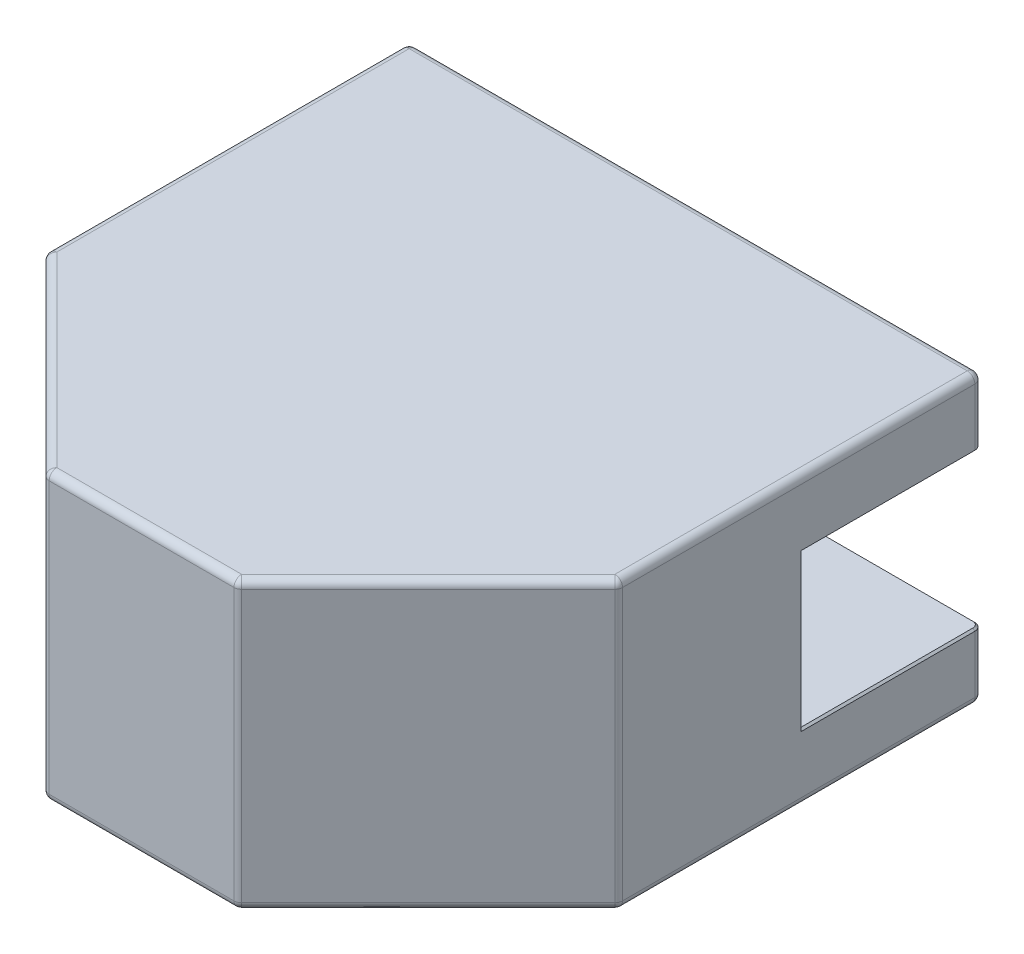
ISO-10303-21;
HEADER;
FILE_DESCRIPTION(('STEP AP214'),'2;1');
FILE_NAME('part.step','',(''),(''),'','','');
FILE_SCHEMA(('AUTOMOTIVE_DESIGN { 1 0 10303 214 1 1 1 1 }'));
ENDSEC;
DATA;
#1=APPLICATION_CONTEXT('core data for automotive mechanical design processes');
#2=APPLICATION_PROTOCOL_DEFINITION('international standard','automotive_design',2000,#1);
#3=PRODUCT_CONTEXT('',#1,'mechanical');
#4=PRODUCT('Part','Part','',(#3));
#5=PRODUCT_RELATED_PRODUCT_CATEGORY('part','',(#4));
#6=PRODUCT_DEFINITION_FORMATION('','',#4);
#7=PRODUCT_DEFINITION_CONTEXT('part definition',#1,'design');
#8=PRODUCT_DEFINITION('design','',#6,#7);
#9=PRODUCT_DEFINITION_SHAPE('','',#8);
#10=(LENGTH_UNIT() NAMED_UNIT(*) SI_UNIT(.MILLI.,.METRE.));
#11=(NAMED_UNIT(*) PLANE_ANGLE_UNIT() SI_UNIT($,.RADIAN.));
#12=(NAMED_UNIT(*) SI_UNIT($,.STERADIAN.) SOLID_ANGLE_UNIT());
#13=UNCERTAINTY_MEASURE_WITH_UNIT(LENGTH_MEASURE(1.E-05),#10,'distance_accuracy_value','');
#14=(GEOMETRIC_REPRESENTATION_CONTEXT(3) GLOBAL_UNCERTAINTY_ASSIGNED_CONTEXT((#13)) GLOBAL_UNIT_ASSIGNED_CONTEXT((#10,
#11,#12)) REPRESENTATION_CONTEXT('',''));
#15=CARTESIAN_POINT('',(0.,0.,0.));
#16=DIRECTION('',(0.,0.,1.));
#17=DIRECTION('',(1.,0.,0.));
#18=AXIS2_PLACEMENT_3D('',#15,#16,#17);
#19=CARTESIAN_POINT('',(0.,75.,0.));
#20=DIRECTION('',(0.,0.,1.));
#21=DIRECTION('',(1.,0.,0.));
#22=AXIS2_PLACEMENT_3D('',#19,#20,#21);
#23=PLANE('',#22);
#24=DIRECTION('',(0.,-1.,0.));
#25=VECTOR('',#24,1.);
#26=CARTESIAN_POINT('',(148.,75.,0.));
#27=LINE('',#26,#25);
#28=CARTESIAN_POINT('',(148.,73.,0.));
#29=VERTEX_POINT('',#28);
#30=CARTESIAN_POINT('',(148.,58.0000000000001,0.));
#31=VERTEX_POINT('',#30);
#32=EDGE_CURVE('E397',#29,#31,#27,.T.);
#33=ORIENTED_EDGE('',*,*,#32,.T.);
#34=DIRECTION('',(-1.,0.,0.));
#35=VECTOR('',#34,1.);
#36=CARTESIAN_POINT('',(0.,58.,0.));
#37=LINE('',#36,#35);
#38=CARTESIAN_POINT('',(2.,58.0000000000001,0.));
#39=VERTEX_POINT('',#38);
#40=EDGE_CURVE('E510',#31,#39,#37,.T.);
#41=ORIENTED_EDGE('',*,*,#40,.T.);
#42=DIRECTION('',(0.,-1.,0.));
#43=VECTOR('',#42,1.);
#44=CARTESIAN_POINT('',(2.,75.,0.));
#45=LINE('',#44,#43);
#46=CARTESIAN_POINT('',(2.,73.,0.));
#47=VERTEX_POINT('',#46);
#48=EDGE_CURVE('E402',#39,#47,#45,.F.);
#49=ORIENTED_EDGE('',*,*,#48,.T.);
#50=DIRECTION('',(-1.,0.,0.));
#51=VECTOR('',#50,1.);
#52=CARTESIAN_POINT('',(0.,73.,0.));
#53=LINE('',#52,#51);
#54=EDGE_CURVE('E400',#47,#29,#53,.F.);
#55=ORIENTED_EDGE('',*,*,#54,.T.);
#56=EDGE_LOOP('',(#33,#41,#49,#55));
#57=FACE_BOUND('',#56,.T.);
#58=ADVANCED_FACE('F49',(#57),#23,.F.);
#59=CARTESIAN_POINT('',(0.,75.,95.));
#60=DIRECTION('',(1.,0.,0.));
#61=DIRECTION('',(0.,0.,-1.));
#62=AXIS2_PLACEMENT_3D('',#59,#60,#61);
#63=PLANE('',#62);
#64=DIRECTION('',(0.,-1.,0.));
#65=VECTOR('',#64,1.);
#66=CARTESIAN_POINT('',(0.,75.,2.));
#67=LINE('',#66,#65);
#68=CARTESIAN_POINT('',(0.,73.,2.));
#69=VERTEX_POINT('',#68);
#70=CARTESIAN_POINT('',(0.,58.0000000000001,2.));
#71=VERTEX_POINT('',#70);
#72=EDGE_CURVE('E357',#69,#71,#67,.T.);
#73=ORIENTED_EDGE('',*,*,#72,.T.);
#74=DIRECTION('',(0.,0.,1.));
#75=VECTOR('',#74,1.);
#76=CARTESIAN_POINT('',(0.,58.,95.));
#77=LINE('',#76,#75);
#78=CARTESIAN_POINT('',(0.,58.,47.5));
#79=VERTEX_POINT('',#78);
#80=EDGE_CURVE('E517',#71,#79,#77,.T.);
#81=ORIENTED_EDGE('',*,*,#80,.T.);
#82=DIRECTION('',(0.,-1.,0.));
#83=VECTOR('',#82,1.);
#84=CARTESIAN_POINT('',(0.,17.5,47.5));
#85=LINE('',#84,#83);
#86=CARTESIAN_POINT('',(0.,17.,47.5));
#87=VERTEX_POINT('',#86);
#88=EDGE_CURVE('E515',#79,#87,#85,.T.);
#89=ORIENTED_EDGE('',*,*,#88,.T.);
#90=DIRECTION('',(0.,0.,-1.));
#91=VECTOR('',#90,1.);
#92=CARTESIAN_POINT('',(0.,17.,95.));
#93=LINE('',#92,#91);
#94=CARTESIAN_POINT('',(0.,17.,2.));
#95=VERTEX_POINT('',#94);
#96=EDGE_CURVE('E513',#87,#95,#93,.T.);
#97=ORIENTED_EDGE('',*,*,#96,.T.);
#98=DIRECTION('',(0.,-1.,0.));
#99=VECTOR('',#98,1.);
#100=CARTESIAN_POINT('',(0.,75.,2.));
#101=LINE('',#100,#99);
#102=CARTESIAN_POINT('',(0.,2.,2.));
#103=VERTEX_POINT('',#102);
#104=EDGE_CURVE('E349',#95,#103,#101,.T.);
#105=ORIENTED_EDGE('',*,*,#104,.T.);
#106=DIRECTION('',(0.,0.,1.));
#107=VECTOR('',#106,1.);
#108=CARTESIAN_POINT('',(0.,2.,95.));
#109=LINE('',#108,#107);
#110=CARTESIAN_POINT('',(0.,2.,94.1715728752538));
#111=VERTEX_POINT('',#110);
#112=EDGE_CURVE('E351',#103,#111,#109,.T.);
#113=ORIENTED_EDGE('',*,*,#112,.T.);
#114=DIRECTION('',(0.,-1.,0.));
#115=VECTOR('',#114,1.);
#116=CARTESIAN_POINT('',(0.,75.,94.1715728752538));
#117=LINE('',#116,#115);
#118=CARTESIAN_POINT('',(0.,73.,94.1715728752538));
#119=VERTEX_POINT('',#118);
#120=EDGE_CURVE('E353',#111,#119,#117,.F.);
#121=ORIENTED_EDGE('',*,*,#120,.T.);
#122=DIRECTION('',(0.,0.,1.));
#123=VECTOR('',#122,1.);
#124=CARTESIAN_POINT('',(0.,73.,95.));
#125=LINE('',#124,#123);
#126=EDGE_CURVE('E355',#119,#69,#125,.F.);
#127=ORIENTED_EDGE('',*,*,#126,.T.);
#128=EDGE_LOOP('',(#73,#81,#89,#97,#105,#113,#121,#127));
#129=FACE_BOUND('',#128,.T.);
#130=ADVANCED_FACE('F633',(#129),#63,.F.);
#131=CARTESIAN_POINT('',(49.9999999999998,75.,145.));
#132=DIRECTION('',(0.707106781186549,0.,-0.707106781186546));
#133=DIRECTION('',(-0.707106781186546,0.,-0.707106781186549));
#134=AXIS2_PLACEMENT_3D('',#131,#132,#133);
#135=PLANE('',#134);
#136=DIRECTION('',(0.,-1.,0.));
#137=VECTOR('',#136,1.);
#138=CARTESIAN_POINT('',(0.585786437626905,75.,95.5857864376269));
#139=LINE('',#138,#137);
#140=CARTESIAN_POINT('',(0.585786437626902,73.,95.5857864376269));
#141=VERTEX_POINT('',#140);
#142=CARTESIAN_POINT('',(0.585786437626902,2.,95.5857864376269));
#143=VERTEX_POINT('',#142);
#144=EDGE_CURVE('E343',#141,#143,#139,.T.);
#145=ORIENTED_EDGE('',*,*,#144,.T.);
#146=DIRECTION('',(0.707106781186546,0.,0.707106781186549));
#147=VECTOR('',#146,1.);
#148=CARTESIAN_POINT('',(49.9999999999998,2.,145.));
#149=LINE('',#148,#147);
#150=CARTESIAN_POINT('',(49.4142135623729,2.,144.414213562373));
#151=VERTEX_POINT('',#150);
#152=EDGE_CURVE('E346',#143,#151,#149,.T.);
#153=ORIENTED_EDGE('',*,*,#152,.T.);
#154=DIRECTION('',(0.,-1.,0.));
#155=VECTOR('',#154,1.);
#156=CARTESIAN_POINT('',(49.4142135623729,75.,144.414213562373));
#157=LINE('',#156,#155);
#158=CARTESIAN_POINT('',(49.4142135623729,73.,144.414213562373));
#159=VERTEX_POINT('',#158);
#160=EDGE_CURVE('E340',#151,#159,#157,.F.);
#161=ORIENTED_EDGE('',*,*,#160,.T.);
#162=DIRECTION('',(0.707106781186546,0.,0.707106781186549));
#163=VECTOR('',#162,1.);
#164=CARTESIAN_POINT('',(49.9999999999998,73.,145.));
#165=LINE('',#164,#163);
#166=EDGE_CURVE('E338',#159,#141,#165,.F.);
#167=ORIENTED_EDGE('',*,*,#166,.T.);
#168=EDGE_LOOP('',(#145,#153,#161,#167));
#169=FACE_BOUND('',#168,.T.);
#170=ADVANCED_FACE('F758',(#169),#135,.F.);
#171=CARTESIAN_POINT('',(100.,75.,145.));
#172=DIRECTION('',(0.,0.,-1.));
#173=DIRECTION('',(-1.,0.,0.));
#174=AXIS2_PLACEMENT_3D('',#171,#172,#173);
#175=PLANE('',#174);
#176=DIRECTION('',(0.,-1.,0.));
#177=VECTOR('',#176,1.);
#178=CARTESIAN_POINT('',(50.828427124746,75.,145.));
#179=LINE('',#178,#177);
#180=CARTESIAN_POINT('',(50.828427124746,73.,145.));
#181=VERTEX_POINT('',#180);
#182=CARTESIAN_POINT('',(50.828427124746,2.,145.));
#183=VERTEX_POINT('',#182);
#184=EDGE_CURVE('E315',#181,#183,#179,.T.);
#185=ORIENTED_EDGE('',*,*,#184,.T.);
#186=DIRECTION('',(1.,0.,0.));
#187=VECTOR('',#186,1.);
#188=CARTESIAN_POINT('',(100.,2.,145.));
#189=LINE('',#188,#187);
#190=CARTESIAN_POINT('',(99.171572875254,2.,145.));
#191=VERTEX_POINT('',#190);
#192=EDGE_CURVE('E322',#183,#191,#189,.T.);
#193=ORIENTED_EDGE('',*,*,#192,.T.);
#194=DIRECTION('',(0.,-1.,0.));
#195=VECTOR('',#194,1.);
#196=CARTESIAN_POINT('',(99.171572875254,75.,145.));
#197=LINE('',#196,#195);
#198=CARTESIAN_POINT('',(99.171572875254,73.,145.));
#199=VERTEX_POINT('',#198);
#200=EDGE_CURVE('E318',#191,#199,#197,.F.);
#201=ORIENTED_EDGE('',*,*,#200,.T.);
#202=DIRECTION('',(1.,0.,0.));
#203=VECTOR('',#202,1.);
#204=CARTESIAN_POINT('',(100.,73.,145.));
#205=LINE('',#204,#203);
#206=EDGE_CURVE('E313',#199,#181,#205,.F.);
#207=ORIENTED_EDGE('',*,*,#206,.T.);
#208=EDGE_LOOP('',(#185,#193,#201,#207));
#209=FACE_BOUND('',#208,.T.);
#210=ADVANCED_FACE('F749',(#209),#175,.F.);
#211=CARTESIAN_POINT('',(150.,75.,95.));
#212=DIRECTION('',(-0.707106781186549,0.,-0.707106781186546));
#213=DIRECTION('',(-0.707106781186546,0.,0.707106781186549));
#214=AXIS2_PLACEMENT_3D('',#211,#212,#213);
#215=PLANE('',#214);
#216=DIRECTION('',(0.,-1.,0.));
#217=VECTOR('',#216,1.);
#218=CARTESIAN_POINT('',(100.585786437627,75.,144.414213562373));
#219=LINE('',#218,#217);
#220=CARTESIAN_POINT('',(100.585786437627,73.,144.414213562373));
#221=VERTEX_POINT('',#220);
#222=CARTESIAN_POINT('',(100.585786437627,2.,144.414213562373));
#223=VERTEX_POINT('',#222);
#224=EDGE_CURVE('E270',#221,#223,#219,.T.);
#225=ORIENTED_EDGE('',*,*,#224,.T.);
#226=DIRECTION('',(0.707106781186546,0.,-0.707106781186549));
#227=VECTOR('',#226,1.);
#228=CARTESIAN_POINT('',(150.,2.,95.));
#229=LINE('',#228,#227);
#230=CARTESIAN_POINT('',(149.414213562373,2.,95.5857864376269));
#231=VERTEX_POINT('',#230);
#232=EDGE_CURVE('E265',#223,#231,#229,.T.);
#233=ORIENTED_EDGE('',*,*,#232,.T.);
#234=DIRECTION('',(0.,-1.,0.));
#235=VECTOR('',#234,1.);
#236=CARTESIAN_POINT('',(149.414213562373,75.,95.5857864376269));
#237=LINE('',#236,#235);
#238=CARTESIAN_POINT('',(149.414213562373,73.,95.5857864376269));
#239=VERTEX_POINT('',#238);
#240=EDGE_CURVE('E257',#231,#239,#237,.F.);
#241=ORIENTED_EDGE('',*,*,#240,.T.);
#242=DIRECTION('',(0.707106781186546,0.,-0.707106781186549));
#243=VECTOR('',#242,1.);
#244=CARTESIAN_POINT('',(150.,73.,95.));
#245=LINE('',#244,#243);
#246=EDGE_CURVE('E262',#239,#221,#245,.F.);
#247=ORIENTED_EDGE('',*,*,#246,.T.);
#248=EDGE_LOOP('',(#225,#233,#241,#247));
#249=FACE_BOUND('',#248,.T.);
#250=ADVANCED_FACE('F260',(#249),#215,.F.);
#251=CARTESIAN_POINT('',(150.,75.,0.));
#252=DIRECTION('',(-1.,0.,0.));
#253=DIRECTION('',(0.,0.,1.));
#254=AXIS2_PLACEMENT_3D('',#251,#252,#253);
#255=PLANE('',#254);
#256=DIRECTION('',(0.,1.,0.));
#257=VECTOR('',#256,1.);
#258=CARTESIAN_POINT('',(150.,57.5,47.5000000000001));
#259=LINE('',#258,#257);
#260=CARTESIAN_POINT('',(150.,16.9999999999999,47.5000000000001));
#261=VERTEX_POINT('',#260);
#262=CARTESIAN_POINT('',(150.,58.0000000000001,47.5000000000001));
#263=VERTEX_POINT('',#262);
#264=EDGE_CURVE('E542',#261,#263,#259,.T.);
#265=ORIENTED_EDGE('',*,*,#264,.T.);
#266=DIRECTION('',(0.,0.,-1.));
#267=VECTOR('',#266,1.);
#268=CARTESIAN_POINT('',(150.,58.0000000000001,0.));
#269=LINE('',#268,#267);
#270=CARTESIAN_POINT('',(150.,58.0000000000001,2.));
#271=VERTEX_POINT('',#270);
#272=EDGE_CURVE('E545',#263,#271,#269,.T.);
#273=ORIENTED_EDGE('',*,*,#272,.T.);
#274=DIRECTION('',(0.,-1.,0.));
#275=VECTOR('',#274,1.);
#276=CARTESIAN_POINT('',(150.,75.,2.));
#277=LINE('',#276,#275);
#278=CARTESIAN_POINT('',(150.,73.,2.));
#279=VERTEX_POINT('',#278);
#280=EDGE_CURVE('E325',#271,#279,#277,.F.);
#281=ORIENTED_EDGE('',*,*,#280,.T.);
#282=DIRECTION('',(0.,0.,-1.));
#283=VECTOR('',#282,1.);
#284=CARTESIAN_POINT('',(150.,73.,0.));
#285=LINE('',#284,#283);
#286=CARTESIAN_POINT('',(150.,73.,94.1715728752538));
#287=VERTEX_POINT('',#286);
#288=EDGE_CURVE('E327',#279,#287,#285,.F.);
#289=ORIENTED_EDGE('',*,*,#288,.T.);
#290=DIRECTION('',(0.,-1.,0.));
#291=VECTOR('',#290,1.);
#292=CARTESIAN_POINT('',(150.,75.,94.1715728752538));
#293=LINE('',#292,#291);
#294=CARTESIAN_POINT('',(150.,2.,94.1715728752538));
#295=VERTEX_POINT('',#294);
#296=EDGE_CURVE('E278',#287,#295,#293,.T.);
#297=ORIENTED_EDGE('',*,*,#296,.T.);
#298=DIRECTION('',(0.,0.,-1.));
#299=VECTOR('',#298,1.);
#300=CARTESIAN_POINT('',(150.,2.,0.));
#301=LINE('',#300,#299);
#302=CARTESIAN_POINT('',(150.,2.,2.));
#303=VERTEX_POINT('',#302);
#304=EDGE_CURVE('E332',#295,#303,#301,.T.);
#305=ORIENTED_EDGE('',*,*,#304,.T.);
#306=DIRECTION('',(0.,-1.,0.));
#307=VECTOR('',#306,1.);
#308=CARTESIAN_POINT('',(150.,75.,2.));
#309=LINE('',#308,#307);
#310=CARTESIAN_POINT('',(150.,17.,2.));
#311=VERTEX_POINT('',#310);
#312=EDGE_CURVE('E335',#303,#311,#309,.F.);
#313=ORIENTED_EDGE('',*,*,#312,.T.);
#314=DIRECTION('',(0.,0.,1.));
#315=VECTOR('',#314,1.);
#316=CARTESIAN_POINT('',(150.,16.9999999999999,0.));
#317=LINE('',#316,#315);
#318=EDGE_CURVE('E539',#311,#261,#317,.T.);
#319=ORIENTED_EDGE('',*,*,#318,.T.);
#320=EDGE_LOOP('',(#265,#273,#281,#289,#297,#305,#313,#319));
#321=FACE_BOUND('',#320,.T.);
#322=ADVANCED_FACE('F603',(#321),#255,.F.);
#323=DIRECTION('',(0.,-1.,0.));
#324=VECTOR('',#323,1.);
#325=CARTESIAN_POINT('',(2.,75.,0.));
#326=LINE('',#325,#324);
#327=CARTESIAN_POINT('',(2.,2.,0.));
#328=VERTEX_POINT('',#327);
#329=CARTESIAN_POINT('',(2.,17.,0.));
#330=VERTEX_POINT('',#329);
#331=EDGE_CURVE('E381',#328,#330,#326,.F.);
#332=ORIENTED_EDGE('',*,*,#331,.T.);
#333=DIRECTION('',(1.,0.,0.));
#334=VECTOR('',#333,1.);
#335=CARTESIAN_POINT('',(0.,17.,0.));
#336=LINE('',#335,#334);
#337=CARTESIAN_POINT('',(148.,17.,0.));
#338=VERTEX_POINT('',#337);
#339=EDGE_CURVE('E11',#330,#338,#336,.T.);
#340=ORIENTED_EDGE('',*,*,#339,.T.);
#341=DIRECTION('',(0.,-1.,0.));
#342=VECTOR('',#341,1.);
#343=CARTESIAN_POINT('',(148.,75.,0.));
#344=LINE('',#343,#342);
#345=CARTESIAN_POINT('',(148.,2.,0.));
#346=VERTEX_POINT('',#345);
#347=EDGE_CURVE('E377',#338,#346,#344,.T.);
#348=ORIENTED_EDGE('',*,*,#347,.T.);
#349=DIRECTION('',(-1.,0.,0.));
#350=VECTOR('',#349,1.);
#351=CARTESIAN_POINT('',(0.,2.,0.));
#352=LINE('',#351,#350);
#353=EDGE_CURVE('E379',#346,#328,#352,.T.);
#354=ORIENTED_EDGE('',*,*,#353,.T.);
#355=EDGE_LOOP('',(#332,#340,#348,#354));
#356=FACE_BOUND('',#355,.T.);
#357=ADVANCED_FACE('F620',(#356),#23,.F.);
#358=CARTESIAN_POINT('',(0.,75.,0.));
#359=DIRECTION('',(0.,-1.,0.));
#360=DIRECTION('',(0.,0.,-1.));
#361=AXIS2_PLACEMENT_3D('',#358,#359,#360);
#362=PLANE('',#361);
#363=DIRECTION('',(0.,0.,-1.));
#364=VECTOR('',#363,1.);
#365=CARTESIAN_POINT('',(148.,75.,0.));
#366=LINE('',#365,#364);
#367=CARTESIAN_POINT('',(148.,75.,94.1715728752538));
#368=VERTEX_POINT('',#367);
#369=CARTESIAN_POINT('',(148.,75.,2.));
#370=VERTEX_POINT('',#369);
#371=EDGE_CURVE('E391',#368,#370,#366,.T.);
#372=ORIENTED_EDGE('',*,*,#371,.T.);
#373=DIRECTION('',(-1.,0.,0.));
#374=VECTOR('',#373,1.);
#375=CARTESIAN_POINT('',(0.,75.,2.));
#376=LINE('',#375,#374);
#377=CARTESIAN_POINT('',(2.,75.,2.));
#378=VERTEX_POINT('',#377);
#379=EDGE_CURVE('E394',#370,#378,#376,.T.);
#380=ORIENTED_EDGE('',*,*,#379,.T.);
#381=DIRECTION('',(0.,0.,1.));
#382=VECTOR('',#381,1.);
#383=CARTESIAN_POINT('',(2.,75.,0.));
#384=LINE('',#383,#382);
#385=CARTESIAN_POINT('',(2.,75.,94.1715728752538));
#386=VERTEX_POINT('',#385);
#387=EDGE_CURVE('E383',#378,#386,#384,.T.);
#388=ORIENTED_EDGE('',*,*,#387,.T.);
#389=DIRECTION('',(0.707106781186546,0.,0.707106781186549));
#390=VECTOR('',#389,1.);
#391=CARTESIAN_POINT('',(-46.0857864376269,75.,46.0857864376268));
#392=LINE('',#391,#390);
#393=CARTESIAN_POINT('',(50.828427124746,75.,143.));
#394=VERTEX_POINT('',#393);
#395=EDGE_CURVE('E385',#386,#394,#392,.T.);
#396=ORIENTED_EDGE('',*,*,#395,.T.);
#397=DIRECTION('',(1.,0.,0.));
#398=VECTOR('',#397,1.);
#399=CARTESIAN_POINT('',(0.,75.,143.));
#400=LINE('',#399,#398);
#401=CARTESIAN_POINT('',(99.171572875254,75.,143.));
#402=VERTEX_POINT('',#401);
#403=EDGE_CURVE('E387',#394,#402,#400,.T.);
#404=ORIENTED_EDGE('',*,*,#403,.T.);
#405=DIRECTION('',(0.707106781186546,0.,-0.707106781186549));
#406=VECTOR('',#405,1.);
#407=CARTESIAN_POINT('',(121.085786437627,75.,121.085786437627));
#408=LINE('',#407,#406);
#409=EDGE_CURVE('E389',#402,#368,#408,.T.);
#410=ORIENTED_EDGE('',*,*,#409,.T.);
#411=EDGE_LOOP('',(#372,#380,#388,#396,#404,#410));
#412=FACE_BOUND('',#411,.T.);
#413=ADVANCED_FACE('F729',(#412),#362,.F.);
#414=CARTESIAN_POINT('',(0.,0.,0.));
#415=DIRECTION('',(0.,-1.,0.));
#416=DIRECTION('',(0.,0.,-1.));
#417=AXIS2_PLACEMENT_3D('',#414,#415,#416);
#418=PLANE('',#417);
#419=CARTESIAN_POINT('',(75.,0.,115.));
#420=DIRECTION('',(0.,-1.,0.));
#421=DIRECTION('',(0.,0.,-1.));
#422=AXIS2_PLACEMENT_3D('',#419,#420,#421);
#423=CIRCLE('',#422,16.);
#424=CARTESIAN_POINT('',(75.,0.,99.));
#425=VERTEX_POINT('',#424);
#426=EDGE_CURVE('E709',#425,#425,#423,.T.);
#427=ORIENTED_EDGE('',*,*,#426,.F.);
#428=EDGE_LOOP('',(#427));
#429=FACE_BOUND('',#428,.T.);
#430=DIRECTION('',(1.,0.,0.));
#431=VECTOR('',#430,1.);
#432=CARTESIAN_POINT('',(49.9999999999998,0.,143.));
#433=LINE('',#432,#431);
#434=CARTESIAN_POINT('',(99.171572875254,0.,143.));
#435=VERTEX_POINT('',#434);
#436=CARTESIAN_POINT('',(50.828427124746,0.,143.));
#437=VERTEX_POINT('',#436);
#438=EDGE_CURVE('E370',#435,#437,#433,.F.);
#439=ORIENTED_EDGE('',*,*,#438,.T.);
#440=DIRECTION('',(0.707106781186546,0.,0.707106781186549));
#441=VECTOR('',#440,1.);
#442=CARTESIAN_POINT('',(1.4142135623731,0.,93.5857864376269));
#443=LINE('',#442,#441);
#444=CARTESIAN_POINT('',(2.,0.,94.1715728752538));
#445=VERTEX_POINT('',#444);
#446=EDGE_CURVE('E373',#437,#445,#443,.F.);
#447=ORIENTED_EDGE('',*,*,#446,.T.);
#448=DIRECTION('',(0.,0.,1.));
#449=VECTOR('',#448,1.);
#450=CARTESIAN_POINT('',(2.,0.,0.));
#451=LINE('',#450,#449);
#452=CARTESIAN_POINT('',(2.,0.,2.));
#453=VERTEX_POINT('',#452);
#454=EDGE_CURVE('E360',#445,#453,#451,.F.);
#455=ORIENTED_EDGE('',*,*,#454,.T.);
#456=DIRECTION('',(-1.,0.,0.));
#457=VECTOR('',#456,1.);
#458=CARTESIAN_POINT('',(150.,0.,2.));
#459=LINE('',#458,#457);
#460=CARTESIAN_POINT('',(148.,0.,2.));
#461=VERTEX_POINT('',#460);
#462=EDGE_CURVE('E362',#453,#461,#459,.F.);
#463=ORIENTED_EDGE('',*,*,#462,.T.);
#464=DIRECTION('',(0.,0.,-1.));
#465=VECTOR('',#464,1.);
#466=CARTESIAN_POINT('',(148.,0.,95.));
#467=LINE('',#466,#465);
#468=CARTESIAN_POINT('',(148.,0.,94.1715728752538));
#469=VERTEX_POINT('',#468);
#470=EDGE_CURVE('E364',#461,#469,#467,.F.);
#471=ORIENTED_EDGE('',*,*,#470,.T.);
#472=DIRECTION('',(0.707106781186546,0.,-0.707106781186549));
#473=VECTOR('',#472,1.);
#474=CARTESIAN_POINT('',(98.5857864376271,0.,143.585786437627));
#475=LINE('',#474,#473);
#476=EDGE_CURVE('E367',#469,#435,#475,.F.);
#477=ORIENTED_EDGE('',*,*,#476,.T.);
#478=EDGE_LOOP('',(#439,#447,#455,#463,#471,#477));
#479=FACE_BOUND('',#478,.T.);
#480=ADVANCED_FACE('F725',(#429,#479),#418,.T.);
#481=CARTESIAN_POINT('',(150.,57.5,47.));
#482=DIRECTION('',(0.,1.,0.));
#483=DIRECTION('',(0.,0.,1.));
#484=AXIS2_PLACEMENT_3D('',#481,#482,#483);
#485=PLANE('',#484);
#486=DIRECTION('',(1.,0.,0.));
#487=VECTOR('',#486,1.);
#488=CARTESIAN_POINT('',(150.,57.5,47.));
#489=LINE('',#488,#487);
#490=CARTESIAN_POINT('',(0.500000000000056,57.5,47.));
#491=VERTEX_POINT('',#490);
#492=CARTESIAN_POINT('',(149.5,57.5,47.));
#493=VERTEX_POINT('',#492);
#494=EDGE_CURVE('E300',#491,#493,#489,.T.);
#495=ORIENTED_EDGE('',*,*,#494,.F.);
#496=DIRECTION('',(0.,0.,-1.));
#497=VECTOR('',#496,1.);
#498=CARTESIAN_POINT('',(0.500000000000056,57.5,47.));
#499=LINE('',#498,#497);
#500=CARTESIAN_POINT('',(0.500000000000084,57.5,2.));
#501=VERTEX_POINT('',#500);
#502=EDGE_CURVE('E508',#491,#501,#499,.T.);
#503=ORIENTED_EDGE('',*,*,#502,.T.);
#504=CARTESIAN_POINT('',(2.,57.5,2.));
#505=DIRECTION('',(0.,1.,0.));
#506=DIRECTION('',(0.,0.,1.));
#507=AXIS2_PLACEMENT_3D('',#504,#505,#506);
#508=CIRCLE('',#507,1.49999999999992);
#509=CARTESIAN_POINT('',(2.,57.5,0.5));
#510=VERTEX_POINT('',#509);
#511=EDGE_CURVE('E506',#501,#510,#508,.F.);
#512=ORIENTED_EDGE('',*,*,#511,.T.);
#513=DIRECTION('',(1.,0.,0.));
#514=VECTOR('',#513,1.);
#515=CARTESIAN_POINT('',(150.,57.5,0.5));
#516=LINE('',#515,#514);
#517=CARTESIAN_POINT('',(148.,57.5,0.500000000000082));
#518=VERTEX_POINT('',#517);
#519=EDGE_CURVE('E503',#510,#518,#516,.T.);
#520=ORIENTED_EDGE('',*,*,#519,.T.);
#521=CARTESIAN_POINT('',(148.,57.5,2.));
#522=DIRECTION('',(0.,1.,0.));
#523=DIRECTION('',(0.,0.,1.));
#524=AXIS2_PLACEMENT_3D('',#521,#522,#523);
#525=CIRCLE('',#524,1.49999999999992);
#526=CARTESIAN_POINT('',(149.5,57.5,2.));
#527=VERTEX_POINT('',#526);
#528=EDGE_CURVE('E501',#518,#527,#525,.F.);
#529=ORIENTED_EDGE('',*,*,#528,.T.);
#530=DIRECTION('',(0.,0.,1.));
#531=VECTOR('',#530,1.);
#532=CARTESIAN_POINT('',(149.5,57.5,47.));
#533=LINE('',#532,#531);
#534=EDGE_CURVE('E404',#527,#493,#533,.T.);
#535=ORIENTED_EDGE('',*,*,#534,.T.);
#536=EDGE_LOOP('',(#495,#503,#512,#520,#529,#535));
#537=FACE_BOUND('',#536,.T.);
#538=ADVANCED_FACE('F728',(#537),#485,.F.);
#539=CARTESIAN_POINT('',(150.,17.5,47.));
#540=DIRECTION('',(0.,-1.,0.));
#541=DIRECTION('',(0.,0.,-1.));
#542=AXIS2_PLACEMENT_3D('',#539,#540,#541);
#543=PLANE('',#542);
#544=CARTESIAN_POINT('',(2.,17.5,2.));
#545=DIRECTION('',(0.,-1.,0.));
#546=DIRECTION('',(0.,0.,-1.));
#547=AXIS2_PLACEMENT_3D('',#544,#545,#546);
#548=CIRCLE('',#547,1.5);
#549=CARTESIAN_POINT('',(2.,17.5,0.5));
#550=VERTEX_POINT('',#549);
#551=CARTESIAN_POINT('',(0.5,17.5,2.));
#552=VERTEX_POINT('',#551);
#553=EDGE_CURVE('E526',#550,#552,#548,.F.);
#554=ORIENTED_EDGE('',*,*,#553,.T.);
#555=DIRECTION('',(0.,0.,1.));
#556=VECTOR('',#555,1.);
#557=CARTESIAN_POINT('',(0.500000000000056,17.5,47.));
#558=LINE('',#557,#556);
#559=CARTESIAN_POINT('',(0.500000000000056,17.5,47.));
#560=VERTEX_POINT('',#559);
#561=EDGE_CURVE('E533',#552,#560,#558,.T.);
#562=ORIENTED_EDGE('',*,*,#561,.T.);
#563=DIRECTION('',(-1.,0.,0.));
#564=VECTOR('',#563,1.);
#565=CARTESIAN_POINT('',(150.,17.5,47.));
#566=LINE('',#565,#564);
#567=CARTESIAN_POINT('',(149.5,17.5,47.));
#568=VERTEX_POINT('',#567);
#569=EDGE_CURVE('E306',#568,#560,#566,.T.);
#570=ORIENTED_EDGE('',*,*,#569,.F.);
#571=DIRECTION('',(0.,0.,-1.));
#572=VECTOR('',#571,1.);
#573=CARTESIAN_POINT('',(149.5,17.5,47.));
#574=LINE('',#573,#572);
#575=CARTESIAN_POINT('',(149.5,17.5,2.));
#576=VERTEX_POINT('',#575);
#577=EDGE_CURVE('E530',#568,#576,#574,.T.);
#578=ORIENTED_EDGE('',*,*,#577,.T.);
#579=CARTESIAN_POINT('',(148.,17.5,2.));
#580=DIRECTION('',(0.,-1.,0.));
#581=DIRECTION('',(0.,0.,-1.));
#582=AXIS2_PLACEMENT_3D('',#579,#580,#581);
#583=CIRCLE('',#582,1.5);
#584=CARTESIAN_POINT('',(148.,17.5,0.5));
#585=VERTEX_POINT('',#584);
#586=EDGE_CURVE('E528',#576,#585,#583,.F.);
#587=ORIENTED_EDGE('',*,*,#586,.T.);
#588=DIRECTION('',(-1.,0.,0.));
#589=VECTOR('',#588,1.);
#590=CARTESIAN_POINT('',(150.,17.5,0.5));
#591=LINE('',#590,#589);
#592=EDGE_CURVE('E524',#585,#550,#591,.T.);
#593=ORIENTED_EDGE('',*,*,#592,.T.);
#594=EDGE_LOOP('',(#554,#562,#570,#578,#587,#593));
#595=FACE_BOUND('',#594,.T.);
#596=ADVANCED_FACE('F701',(#595),#543,.F.);
#597=CARTESIAN_POINT('',(0.,0.,47.));
#598=DIRECTION('',(0.,0.,-1.));
#599=DIRECTION('',(-1.,0.,0.));
#600=AXIS2_PLACEMENT_3D('',#597,#598,#599);
#601=PLANE('',#600);
#602=ORIENTED_EDGE('',*,*,#569,.T.);
#603=DIRECTION('',(0.,1.,0.));
#604=VECTOR('',#603,1.);
#605=CARTESIAN_POINT('',(0.500000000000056,57.5,47.));
#606=LINE('',#605,#604);
#607=EDGE_CURVE('E522',#560,#491,#606,.T.);
#608=ORIENTED_EDGE('',*,*,#607,.T.);
#609=ORIENTED_EDGE('',*,*,#494,.T.);
#610=DIRECTION('',(0.,-1.,0.));
#611=VECTOR('',#610,1.);
#612=CARTESIAN_POINT('',(149.5,17.5,47.));
#613=LINE('',#612,#611);
#614=EDGE_CURVE('E519',#493,#568,#613,.T.);
#615=ORIENTED_EDGE('',*,*,#614,.T.);
#616=EDGE_LOOP('',(#602,#608,#609,#615));
#617=FACE_BOUND('',#616,.T.);
#618=ADVANCED_FACE('F704',(#617),#601,.T.);
#619=CARTESIAN_POINT('',(2.,75.,2.));
#620=DIRECTION('',(0.,-1.,0.));
#621=DIRECTION('',(0.,0.,-1.));
#622=AXIS2_PLACEMENT_3D('',#619,#620,#621);
#623=CYLINDRICAL_SURFACE('',#622,2.);
#624=ORIENTED_EDGE('',*,*,#48,.F.);
#625=CARTESIAN_POINT('',(2.,58.0000000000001,2.));
#626=DIRECTION('',(0.,1.,0.));
#627=DIRECTION('',(0.,0.,1.));
#628=AXIS2_PLACEMENT_3D('',#625,#626,#627);
#629=CIRCLE('',#628,2.);
#630=EDGE_CURVE('E535',#39,#71,#629,.T.);
#631=ORIENTED_EDGE('',*,*,#630,.T.);
#632=ORIENTED_EDGE('',*,*,#72,.F.);
#633=CARTESIAN_POINT('',(2.,73.,2.));
#634=DIRECTION('',(0.,1.,0.));
#635=DIRECTION('',(0.,0.,1.));
#636=AXIS2_PLACEMENT_3D('',#633,#634,#635);
#637=CIRCLE('',#636,2.);
#638=EDGE_CURVE('E496',#47,#69,#637,.T.);
#639=ORIENTED_EDGE('',*,*,#638,.F.);
#640=EDGE_LOOP('',(#624,#631,#632,#639));
#641=FACE_BOUND('',#640,.T.);
#642=ADVANCED_FACE('F653',(#641),#623,.T.);
#643=CARTESIAN_POINT('',(2.,75.,2.));
#644=DIRECTION('',(0.,-1.,0.));
#645=DIRECTION('',(0.,0.,-1.));
#646=AXIS2_PLACEMENT_3D('',#643,#644,#645);
#647=CYLINDRICAL_SURFACE('',#646,2.);
#648=ORIENTED_EDGE('',*,*,#104,.F.);
#649=CARTESIAN_POINT('',(2.,17.,2.));
#650=DIRECTION('',(0.,-1.,0.));
#651=DIRECTION('',(0.,0.,-1.));
#652=AXIS2_PLACEMENT_3D('',#649,#650,#651);
#653=CIRCLE('',#652,2.);
#654=EDGE_CURVE('E59',#95,#330,#653,.T.);
#655=ORIENTED_EDGE('',*,*,#654,.T.);
#656=ORIENTED_EDGE('',*,*,#331,.F.);
#657=CARTESIAN_POINT('',(2.,2.,2.));
#658=DIRECTION('',(0.,-1.,0.));
#659=DIRECTION('',(0.,0.,-1.));
#660=AXIS2_PLACEMENT_3D('',#657,#658,#659);
#661=CIRCLE('',#660,2.);
#662=EDGE_CURVE('E493',#103,#328,#661,.T.);
#663=ORIENTED_EDGE('',*,*,#662,.F.);
#664=EDGE_LOOP('',(#648,#655,#656,#663));
#665=FACE_BOUND('',#664,.T.);
#666=ADVANCED_FACE('F622',(#665),#647,.T.);
#667=CARTESIAN_POINT('',(2.,73.,2.));
#668=DIRECTION('',(-1.,0.,0.));
#669=DIRECTION('',(0.,0.,1.));
#670=AXIS2_PLACEMENT_3D('',#667,#668,#669);
#671=SPHERICAL_SURFACE('',#670,2.);
#672=CARTESIAN_POINT('',(2.,73.,2.));
#673=DIRECTION('',(-1.,0.,0.));
#674=DIRECTION('',(0.,0.,1.));
#675=AXIS2_PLACEMENT_3D('',#672,#673,#674);
#676=CIRCLE('',#675,2.);
#677=EDGE_CURVE('E487',#47,#378,#676,.F.);
#678=ORIENTED_EDGE('',*,*,#677,.F.);
#679=ORIENTED_EDGE('',*,*,#638,.T.);
#680=CARTESIAN_POINT('',(2.,73.,2.));
#681=DIRECTION('',(0.,0.,-1.));
#682=DIRECTION('',(0.,1.,0.));
#683=AXIS2_PLACEMENT_3D('',#680,#681,#682);
#684=CIRCLE('',#683,2.);
#685=EDGE_CURVE('E490',#378,#69,#684,.F.);
#686=ORIENTED_EDGE('',*,*,#685,.F.);
#687=EDGE_LOOP('',(#678,#679,#686));
#688=FACE_BOUND('',#687,.T.);
#689=ADVANCED_FACE('F657',(#688),#671,.T.);
#690=CARTESIAN_POINT('',(2.,2.,2.));
#691=DIRECTION('',(0.,0.,-1.));
#692=DIRECTION('',(0.,1.,0.));
#693=AXIS2_PLACEMENT_3D('',#690,#691,#692);
#694=SPHERICAL_SURFACE('',#693,2.);
#695=CARTESIAN_POINT('',(2.,2.,2.));
#696=DIRECTION('',(0.,0.,-1.));
#697=DIRECTION('',(-1.,0.,0.));
#698=AXIS2_PLACEMENT_3D('',#695,#696,#697);
#699=CIRCLE('',#698,2.);
#700=EDGE_CURVE('E481',#103,#453,#699,.F.);
#701=ORIENTED_EDGE('',*,*,#700,.F.);
#702=ORIENTED_EDGE('',*,*,#662,.T.);
#703=CARTESIAN_POINT('',(2.,2.,2.));
#704=DIRECTION('',(-1.,0.,0.));
#705=DIRECTION('',(0.,0.,1.));
#706=AXIS2_PLACEMENT_3D('',#703,#704,#705);
#707=CIRCLE('',#706,2.);
#708=EDGE_CURVE('E484',#453,#328,#707,.F.);
#709=ORIENTED_EDGE('',*,*,#708,.F.);
#710=EDGE_LOOP('',(#701,#702,#709));
#711=FACE_BOUND('',#710,.T.);
#712=ADVANCED_FACE('F625',(#711),#694,.T.);
#713=CARTESIAN_POINT('',(2.,73.,0.));
#714=DIRECTION('',(0.,0.,1.));
#715=DIRECTION('',(1.,0.,0.));
#716=AXIS2_PLACEMENT_3D('',#713,#714,#715);
#717=CYLINDRICAL_SURFACE('',#716,2.);
#718=ORIENTED_EDGE('',*,*,#685,.T.);
#719=ORIENTED_EDGE('',*,*,#126,.F.);
#720=CARTESIAN_POINT('',(2.,73.,94.1715728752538));
#721=DIRECTION('',(0.,0.,1.));
#722=DIRECTION('',(1.,0.,0.));
#723=AXIS2_PLACEMENT_3D('',#720,#721,#722);
#724=CIRCLE('',#723,2.);
#725=EDGE_CURVE('E475',#386,#119,#724,.T.);
#726=ORIENTED_EDGE('',*,*,#725,.F.);
#727=ORIENTED_EDGE('',*,*,#387,.F.);
#728=EDGE_LOOP('',(#718,#719,#726,#727));
#729=FACE_BOUND('',#728,.T.);
#730=ADVANCED_FACE('F646',(#729),#717,.T.);
#731=CARTESIAN_POINT('',(0.,73.,2.));
#732=DIRECTION('',(-1.,0.,0.));
#733=DIRECTION('',(0.,0.,1.));
#734=AXIS2_PLACEMENT_3D('',#731,#732,#733);
#735=CYLINDRICAL_SURFACE('',#734,2.);
#736=ORIENTED_EDGE('',*,*,#677,.T.);
#737=ORIENTED_EDGE('',*,*,#379,.F.);
#738=CARTESIAN_POINT('',(148.,73.,2.));
#739=DIRECTION('',(1.,0.,0.));
#740=DIRECTION('',(0.,0.,-1.));
#741=AXIS2_PLACEMENT_3D('',#738,#739,#740);
#742=CIRCLE('',#741,2.);
#743=EDGE_CURVE('E472',#29,#370,#742,.T.);
#744=ORIENTED_EDGE('',*,*,#743,.F.);
#745=ORIENTED_EDGE('',*,*,#54,.F.);
#746=EDGE_LOOP('',(#736,#737,#744,#745));
#747=FACE_BOUND('',#746,.T.);
#748=ADVANCED_FACE('F662',(#747),#735,.T.);
#749=CARTESIAN_POINT('',(148.,75.,2.));
#750=DIRECTION('',(0.,-1.,0.));
#751=DIRECTION('',(0.,0.,-1.));
#752=AXIS2_PLACEMENT_3D('',#749,#750,#751);
#753=CYLINDRICAL_SURFACE('',#752,2.);
#754=ORIENTED_EDGE('',*,*,#280,.F.);
#755=CARTESIAN_POINT('',(148.,58.0000000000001,2.));
#756=DIRECTION('',(0.,1.,0.));
#757=DIRECTION('',(0.,0.,1.));
#758=AXIS2_PLACEMENT_3D('',#755,#756,#757);
#759=CIRCLE('',#758,2.);
#760=EDGE_CURVE('E537',#271,#31,#759,.T.);
#761=ORIENTED_EDGE('',*,*,#760,.T.);
#762=ORIENTED_EDGE('',*,*,#32,.F.);
#763=CARTESIAN_POINT('',(148.,73.,2.));
#764=DIRECTION('',(0.,1.,0.));
#765=DIRECTION('',(0.,0.,1.));
#766=AXIS2_PLACEMENT_3D('',#763,#764,#765);
#767=CIRCLE('',#766,2.);
#768=EDGE_CURVE('E469',#279,#29,#767,.T.);
#769=ORIENTED_EDGE('',*,*,#768,.F.);
#770=EDGE_LOOP('',(#754,#761,#762,#769));
#771=FACE_BOUND('',#770,.T.);
#772=ADVANCED_FACE('F669',(#771),#753,.T.);
#773=CARTESIAN_POINT('',(148.,75.,2.));
#774=DIRECTION('',(0.,-1.,0.));
#775=DIRECTION('',(0.,0.,-1.));
#776=AXIS2_PLACEMENT_3D('',#773,#774,#775);
#777=CYLINDRICAL_SURFACE('',#776,2.);
#778=ORIENTED_EDGE('',*,*,#347,.F.);
#779=CARTESIAN_POINT('',(148.,17.,2.));
#780=DIRECTION('',(0.,-1.,0.));
#781=DIRECTION('',(0.,0.,-1.));
#782=AXIS2_PLACEMENT_3D('',#779,#780,#781);
#783=CIRCLE('',#782,2.);
#784=EDGE_CURVE('E548',#338,#311,#783,.T.);
#785=ORIENTED_EDGE('',*,*,#784,.T.);
#786=ORIENTED_EDGE('',*,*,#312,.F.);
#787=CARTESIAN_POINT('',(148.,2.,2.));
#788=DIRECTION('',(0.,-1.,0.));
#789=DIRECTION('',(0.,0.,-1.));
#790=AXIS2_PLACEMENT_3D('',#787,#788,#789);
#791=CIRCLE('',#790,2.);
#792=EDGE_CURVE('E466',#346,#303,#791,.T.);
#793=ORIENTED_EDGE('',*,*,#792,.F.);
#794=EDGE_LOOP('',(#778,#785,#786,#793));
#795=FACE_BOUND('',#794,.T.);
#796=ADVANCED_FACE('F600',(#795),#777,.T.);
#797=CARTESIAN_POINT('',(0.,2.,2.));
#798=DIRECTION('',(1.,0.,0.));
#799=DIRECTION('',(0.,0.,-1.));
#800=AXIS2_PLACEMENT_3D('',#797,#798,#799);
#801=CYLINDRICAL_SURFACE('',#800,2.);
#802=ORIENTED_EDGE('',*,*,#708,.T.);
#803=ORIENTED_EDGE('',*,*,#353,.F.);
#804=CARTESIAN_POINT('',(148.,2.,2.));
#805=DIRECTION('',(1.,0.,0.));
#806=DIRECTION('',(0.,0.,-1.));
#807=AXIS2_PLACEMENT_3D('',#804,#805,#806);
#808=CIRCLE('',#807,2.);
#809=EDGE_CURVE('E463',#461,#346,#808,.T.);
#810=ORIENTED_EDGE('',*,*,#809,.F.);
#811=ORIENTED_EDGE('',*,*,#462,.F.);
#812=EDGE_LOOP('',(#802,#803,#810,#811));
#813=FACE_BOUND('',#812,.T.);
#814=ADVANCED_FACE('F618',(#813),#801,.T.);
#815=CARTESIAN_POINT('',(2.,2.,95.));
#816=DIRECTION('',(0.,0.,-1.));
#817=DIRECTION('',(-1.,0.,0.));
#818=AXIS2_PLACEMENT_3D('',#815,#816,#817);
#819=CYLINDRICAL_SURFACE('',#818,2.);
#820=ORIENTED_EDGE('',*,*,#700,.T.);
#821=ORIENTED_EDGE('',*,*,#454,.F.);
#822=CARTESIAN_POINT('',(2.,2.,94.1715728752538));
#823=DIRECTION('',(0.,0.,1.));
#824=DIRECTION('',(0.,-1.,0.));
#825=AXIS2_PLACEMENT_3D('',#822,#823,#824);
#826=CIRCLE('',#825,2.);
#827=EDGE_CURVE('E460',#111,#445,#826,.T.);
#828=ORIENTED_EDGE('',*,*,#827,.F.);
#829=ORIENTED_EDGE('',*,*,#112,.F.);
#830=EDGE_LOOP('',(#820,#821,#828,#829));
#831=FACE_BOUND('',#830,.T.);
#832=ADVANCED_FACE('F630',(#831),#819,.T.);
#833=CARTESIAN_POINT('',(2.,75.,94.1715728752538));
#834=DIRECTION('',(0.,-1.,0.));
#835=DIRECTION('',(0.,0.,-1.));
#836=AXIS2_PLACEMENT_3D('',#833,#834,#835);
#837=CYLINDRICAL_SURFACE('',#836,2.);
#838=CARTESIAN_POINT('',(2.,73.,94.1715728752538));
#839=DIRECTION('',(0.,1.,0.));
#840=DIRECTION('',(0.,0.,1.));
#841=AXIS2_PLACEMENT_3D('',#838,#839,#840);
#842=CIRCLE('',#841,2.);
#843=EDGE_CURVE('E478',#119,#141,#842,.T.);
#844=ORIENTED_EDGE('',*,*,#843,.F.);
#845=ORIENTED_EDGE('',*,*,#120,.F.);
#846=CARTESIAN_POINT('',(2.,2.,94.1715728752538));
#847=DIRECTION('',(0.,-1.,0.));
#848=DIRECTION('',(0.,0.,-1.));
#849=AXIS2_PLACEMENT_3D('',#846,#847,#848);
#850=CIRCLE('',#849,2.);
#851=EDGE_CURVE('E457',#143,#111,#850,.T.);
#852=ORIENTED_EDGE('',*,*,#851,.F.);
#853=ORIENTED_EDGE('',*,*,#144,.F.);
#854=EDGE_LOOP('',(#844,#845,#852,#853));
#855=FACE_BOUND('',#854,.T.);
#856=ADVANCED_FACE('F638',(#855),#837,.T.);
#857=CARTESIAN_POINT('',(2.,73.,94.1715728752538));
#858=DIRECTION('',(0.,1.,0.));
#859=DIRECTION('',(0.,0.,1.));
#860=AXIS2_PLACEMENT_3D('',#857,#858,#859);
#861=SPHERICAL_SURFACE('',#860,2.);
#862=ORIENTED_EDGE('',*,*,#725,.T.);
#863=ORIENTED_EDGE('',*,*,#843,.T.);
#864=CARTESIAN_POINT('',(2.,73.,94.1715728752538));
#865=DIRECTION('',(-0.707106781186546,0.,-0.707106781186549));
#866=DIRECTION('',(-0.707106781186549,0.,0.707106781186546));
#867=AXIS2_PLACEMENT_3D('',#864,#865,#866);
#868=CIRCLE('',#867,2.);
#869=EDGE_CURVE('E454',#386,#141,#868,.F.);
#870=ORIENTED_EDGE('',*,*,#869,.F.);
#871=EDGE_LOOP('',(#862,#863,#870));
#872=FACE_BOUND('',#871,.T.);
#873=ADVANCED_FACE('F643',(#872),#861,.T.);
#874=CARTESIAN_POINT('',(148.,73.,2.));
#875=DIRECTION('',(0.,0.,-1.));
#876=DIRECTION('',(-1.,0.,0.));
#877=AXIS2_PLACEMENT_3D('',#874,#875,#876);
#878=SPHERICAL_SURFACE('',#877,2.);
#879=ORIENTED_EDGE('',*,*,#768,.T.);
#880=ORIENTED_EDGE('',*,*,#743,.T.);
#881=CARTESIAN_POINT('',(148.,73.,2.));
#882=DIRECTION('',(0.,0.,-1.));
#883=DIRECTION('',(-1.,0.,0.));
#884=AXIS2_PLACEMENT_3D('',#881,#882,#883);
#885=CIRCLE('',#884,2.);
#886=EDGE_CURVE('E451',#279,#370,#885,.F.);
#887=ORIENTED_EDGE('',*,*,#886,.F.);
#888=EDGE_LOOP('',(#879,#880,#887));
#889=FACE_BOUND('',#888,.T.);
#890=ADVANCED_FACE('F767',(#889),#878,.T.);
#891=CARTESIAN_POINT('',(148.,2.,2.));
#892=DIRECTION('',(0.,0.,-1.));
#893=DIRECTION('',(0.,1.,0.));
#894=AXIS2_PLACEMENT_3D('',#891,#892,#893);
#895=SPHERICAL_SURFACE('',#894,2.);
#896=ORIENTED_EDGE('',*,*,#809,.T.);
#897=ORIENTED_EDGE('',*,*,#792,.T.);
#898=CARTESIAN_POINT('',(148.,2.,2.));
#899=DIRECTION('',(0.,0.,-1.));
#900=DIRECTION('',(-1.,0.,0.));
#901=AXIS2_PLACEMENT_3D('',#898,#899,#900);
#902=CIRCLE('',#901,2.);
#903=EDGE_CURVE('E448',#461,#303,#902,.F.);
#904=ORIENTED_EDGE('',*,*,#903,.F.);
#905=EDGE_LOOP('',(#896,#897,#904));
#906=FACE_BOUND('',#905,.T.);
#907=ADVANCED_FACE('F613',(#906),#895,.T.);
#908=CARTESIAN_POINT('',(2.,2.,94.1715728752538));
#909=DIRECTION('',(0.,-1.,0.));
#910=DIRECTION('',(0.,0.,-1.));
#911=AXIS2_PLACEMENT_3D('',#908,#909,#910);
#912=SPHERICAL_SURFACE('',#911,2.);
#913=ORIENTED_EDGE('',*,*,#851,.T.);
#914=ORIENTED_EDGE('',*,*,#827,.T.);
#915=CARTESIAN_POINT('',(2.,2.,94.1715728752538));
#916=DIRECTION('',(-0.707106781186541,0.,-0.707106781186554));
#917=DIRECTION('',(-0.707106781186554,0.,0.707106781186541));
#918=AXIS2_PLACEMENT_3D('',#915,#916,#917);
#919=CIRCLE('',#918,2.);
#920=EDGE_CURVE('E446',#143,#445,#919,.F.);
#921=ORIENTED_EDGE('',*,*,#920,.F.);
#922=EDGE_LOOP('',(#913,#914,#921));
#923=FACE_BOUND('',#922,.T.);
#924=ADVANCED_FACE('F861',(#923),#912,.T.);
#925=CARTESIAN_POINT('',(-46.0857864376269,73.,46.0857864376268));
#926=DIRECTION('',(0.707106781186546,0.,0.707106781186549));
#927=DIRECTION('',(0.707106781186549,0.,-0.707106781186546));
#928=AXIS2_PLACEMENT_3D('',#925,#926,#927);
#929=CYLINDRICAL_SURFACE('',#928,2.);
#930=ORIENTED_EDGE('',*,*,#869,.T.);
#931=ORIENTED_EDGE('',*,*,#166,.F.);
#932=CARTESIAN_POINT('',(50.828427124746,73.,143.));
#933=DIRECTION('',(0.707106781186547,0.,0.707106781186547));
#934=DIRECTION('',(0.707106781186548,0.,-0.707106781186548));
#935=AXIS2_PLACEMENT_3D('',#932,#933,#934);
#936=CIRCLE('',#935,2.);
#937=EDGE_CURVE('E440',#394,#159,#936,.T.);
#938=ORIENTED_EDGE('',*,*,#937,.F.);
#939=ORIENTED_EDGE('',*,*,#395,.F.);
#940=EDGE_LOOP('',(#930,#931,#938,#939));
#941=FACE_BOUND('',#940,.T.);
#942=ADVANCED_FACE('F761',(#941),#929,.T.);
#943=CARTESIAN_POINT('',(148.,73.,0.));
#944=DIRECTION('',(0.,0.,-1.));
#945=DIRECTION('',(-1.,0.,0.));
#946=AXIS2_PLACEMENT_3D('',#943,#944,#945);
#947=CYLINDRICAL_SURFACE('',#946,2.);
#948=ORIENTED_EDGE('',*,*,#886,.T.);
#949=ORIENTED_EDGE('',*,*,#371,.F.);
#950=CARTESIAN_POINT('',(148.,73.,94.1715728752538));
#951=DIRECTION('',(0.,0.,1.));
#952=DIRECTION('',(0.,-1.,0.));
#953=AXIS2_PLACEMENT_3D('',#950,#951,#952);
#954=CIRCLE('',#953,2.);
#955=EDGE_CURVE('E283',#287,#368,#954,.T.);
#956=ORIENTED_EDGE('',*,*,#955,.F.);
#957=ORIENTED_EDGE('',*,*,#288,.F.);
#958=EDGE_LOOP('',(#948,#949,#956,#957));
#959=FACE_BOUND('',#958,.T.);
#960=ADVANCED_FACE('F770',(#959),#947,.T.);
#961=CARTESIAN_POINT('',(148.,75.,94.1715728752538));
#962=DIRECTION('',(0.,-1.,0.));
#963=DIRECTION('',(0.,0.,-1.));
#964=AXIS2_PLACEMENT_3D('',#961,#962,#963);
#965=CYLINDRICAL_SURFACE('',#964,2.);
#966=CARTESIAN_POINT('',(148.,2.,94.1715728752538));
#967=DIRECTION('',(0.,-1.,0.));
#968=DIRECTION('',(0.,0.,-1.));
#969=AXIS2_PLACEMENT_3D('',#966,#967,#968);
#970=CIRCLE('',#969,2.);
#971=EDGE_CURVE('E284',#295,#231,#970,.T.);
#972=ORIENTED_EDGE('',*,*,#971,.F.);
#973=ORIENTED_EDGE('',*,*,#296,.F.);
#974=CARTESIAN_POINT('',(148.,73.,94.1715728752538));
#975=DIRECTION('',(0.,1.,0.));
#976=DIRECTION('',(0.,0.,1.));
#977=AXIS2_PLACEMENT_3D('',#974,#975,#976);
#978=CIRCLE('',#977,2.);
#979=EDGE_CURVE('E274',#239,#287,#978,.T.);
#980=ORIENTED_EDGE('',*,*,#979,.F.);
#981=ORIENTED_EDGE('',*,*,#240,.F.);
#982=EDGE_LOOP('',(#972,#973,#980,#981));
#983=FACE_BOUND('',#982,.T.);
#984=ADVANCED_FACE('F276',(#983),#965,.T.);
#985=CARTESIAN_POINT('',(148.,2.,0.));
#986=DIRECTION('',(0.,0.,1.));
#987=DIRECTION('',(1.,0.,0.));
#988=AXIS2_PLACEMENT_3D('',#985,#986,#987);
#989=CYLINDRICAL_SURFACE('',#988,2.);
#990=ORIENTED_EDGE('',*,*,#903,.T.);
#991=ORIENTED_EDGE('',*,*,#304,.F.);
#992=CARTESIAN_POINT('',(148.,2.,94.1715728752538));
#993=DIRECTION('',(0.,0.,1.));
#994=DIRECTION('',(1.,0.,0.));
#995=AXIS2_PLACEMENT_3D('',#992,#993,#994);
#996=CIRCLE('',#995,2.);
#997=EDGE_CURVE('E435',#469,#295,#996,.T.);
#998=ORIENTED_EDGE('',*,*,#997,.F.);
#999=ORIENTED_EDGE('',*,*,#470,.F.);
#1000=EDGE_LOOP('',(#990,#991,#998,#999));
#1001=FACE_BOUND('',#1000,.T.);
#1002=ADVANCED_FACE('F608',(#1001),#989,.T.);
#1003=CARTESIAN_POINT('',(51.4142135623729,2.,143.585786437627));
#1004=DIRECTION('',(-0.707106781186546,0.,-0.707106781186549));
#1005=DIRECTION('',(-0.707106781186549,0.,0.707106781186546));
#1006=AXIS2_PLACEMENT_3D('',#1003,#1004,#1005);
#1007=CYLINDRICAL_SURFACE('',#1006,2.);
#1008=ORIENTED_EDGE('',*,*,#920,.T.);
#1009=ORIENTED_EDGE('',*,*,#446,.F.);
#1010=CARTESIAN_POINT('',(50.828427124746,2.,143.));
#1011=DIRECTION('',(0.707106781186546,0.,0.707106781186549));
#1012=DIRECTION('',(0.707106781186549,0.,-0.707106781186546));
#1013=AXIS2_PLACEMENT_3D('',#1010,#1011,#1012);
#1014=CIRCLE('',#1013,2.);
#1015=EDGE_CURVE('E431',#151,#437,#1014,.T.);
#1016=ORIENTED_EDGE('',*,*,#1015,.F.);
#1017=ORIENTED_EDGE('',*,*,#152,.F.);
#1018=EDGE_LOOP('',(#1008,#1009,#1016,#1017));
#1019=FACE_BOUND('',#1018,.T.);
#1020=ADVANCED_FACE('F739',(#1019),#1007,.T.);
#1021=CARTESIAN_POINT('',(50.828427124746,75.,143.));
#1022=DIRECTION('',(0.,-1.,0.));
#1023=DIRECTION('',(0.,0.,-1.));
#1024=AXIS2_PLACEMENT_3D('',#1021,#1022,#1023);
#1025=CYLINDRICAL_SURFACE('',#1024,2.);
#1026=CARTESIAN_POINT('',(50.828427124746,73.,143.));
#1027=DIRECTION('',(0.,1.,0.));
#1028=DIRECTION('',(0.,0.,1.));
#1029=AXIS2_PLACEMENT_3D('',#1026,#1027,#1028);
#1030=CIRCLE('',#1029,2.);
#1031=EDGE_CURVE('E443',#159,#181,#1030,.T.);
#1032=ORIENTED_EDGE('',*,*,#1031,.F.);
#1033=ORIENTED_EDGE('',*,*,#160,.F.);
#1034=CARTESIAN_POINT('',(50.828427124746,2.,143.));
#1035=DIRECTION('',(0.,-1.,0.));
#1036=DIRECTION('',(0.,0.,-1.));
#1037=AXIS2_PLACEMENT_3D('',#1034,#1035,#1036);
#1038=CIRCLE('',#1037,2.);
#1039=EDGE_CURVE('E427',#183,#151,#1038,.T.);
#1040=ORIENTED_EDGE('',*,*,#1039,.F.);
#1041=ORIENTED_EDGE('',*,*,#184,.F.);
#1042=EDGE_LOOP('',(#1032,#1033,#1040,#1041));
#1043=FACE_BOUND('',#1042,.T.);
#1044=ADVANCED_FACE('F755',(#1043),#1025,.T.);
#1045=CARTESIAN_POINT('',(50.828427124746,73.,143.));
#1046=DIRECTION('',(0.,1.,0.));
#1047=DIRECTION('',(-1.,0.,0.));
#1048=AXIS2_PLACEMENT_3D('',#1045,#1046,#1047);
#1049=SPHERICAL_SURFACE('',#1048,2.);
#1050=ORIENTED_EDGE('',*,*,#937,.T.);
#1051=ORIENTED_EDGE('',*,*,#1031,.T.);
#1052=CARTESIAN_POINT('',(50.828427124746,73.,143.));
#1053=DIRECTION('',(-1.,0.,0.));
#1054=DIRECTION('',(0.,0.,1.));
#1055=AXIS2_PLACEMENT_3D('',#1052,#1053,#1054);
#1056=CIRCLE('',#1055,2.);
#1057=EDGE_CURVE('E292',#394,#181,#1056,.F.);
#1058=ORIENTED_EDGE('',*,*,#1057,.F.);
#1059=EDGE_LOOP('',(#1050,#1051,#1058));
#1060=FACE_BOUND('',#1059,.T.);
#1061=ADVANCED_FACE('F845',(#1060),#1049,.T.);
#1062=CARTESIAN_POINT('',(148.,73.,94.1715728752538));
#1063=DIRECTION('',(0.,1.,0.));
#1064=DIRECTION('',(0.,0.,1.));
#1065=AXIS2_PLACEMENT_3D('',#1062,#1063,#1064);
#1066=SPHERICAL_SURFACE('',#1065,2.);
#1067=ORIENTED_EDGE('',*,*,#979,.T.);
#1068=ORIENTED_EDGE('',*,*,#955,.T.);
#1069=CARTESIAN_POINT('',(148.,73.,94.1715728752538));
#1070=DIRECTION('',(0.707106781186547,0.,-0.707106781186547));
#1071=DIRECTION('',(-0.707106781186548,0.,-0.707106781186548));
#1072=AXIS2_PLACEMENT_3D('',#1069,#1070,#1071);
#1073=CIRCLE('',#1072,2.);
#1074=EDGE_CURVE('E287',#239,#368,#1073,.F.);
#1075=ORIENTED_EDGE('',*,*,#1074,.F.);
#1076=EDGE_LOOP('',(#1067,#1068,#1075));
#1077=FACE_BOUND('',#1076,.T.);
#1078=ADVANCED_FACE('F288',(#1077),#1066,.T.);
#1079=CARTESIAN_POINT('',(148.,2.,94.1715728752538));
#1080=DIRECTION('',(0.,-1.,0.));
#1081=DIRECTION('',(0.,0.,-1.));
#1082=AXIS2_PLACEMENT_3D('',#1079,#1080,#1081);
#1083=SPHERICAL_SURFACE('',#1082,2.);
#1084=ORIENTED_EDGE('',*,*,#997,.T.);
#1085=ORIENTED_EDGE('',*,*,#971,.T.);
#1086=CARTESIAN_POINT('',(148.,2.,94.1715728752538));
#1087=DIRECTION('',(0.707106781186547,0.,-0.707106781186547));
#1088=DIRECTION('',(-0.707106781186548,0.,-0.707106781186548));
#1089=AXIS2_PLACEMENT_3D('',#1086,#1087,#1088);
#1090=CIRCLE('',#1089,2.);
#1091=EDGE_CURVE('E293',#469,#231,#1090,.F.);
#1092=ORIENTED_EDGE('',*,*,#1091,.F.);
#1093=EDGE_LOOP('',(#1084,#1085,#1092));
#1094=FACE_BOUND('',#1093,.T.);
#1095=ADVANCED_FACE('F839',(#1094),#1083,.T.);
#1096=CARTESIAN_POINT('',(50.828427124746,2.,143.));
#1097=DIRECTION('',(0.,-1.,0.));
#1098=DIRECTION('',(0.,0.,-1.));
#1099=AXIS2_PLACEMENT_3D('',#1096,#1097,#1098);
#1100=SPHERICAL_SURFACE('',#1099,2.);
#1101=ORIENTED_EDGE('',*,*,#1039,.T.);
#1102=ORIENTED_EDGE('',*,*,#1015,.T.);
#1103=CARTESIAN_POINT('',(50.828427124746,2.,143.));
#1104=DIRECTION('',(-1.,0.,0.));
#1105=DIRECTION('',(0.,0.,1.));
#1106=AXIS2_PLACEMENT_3D('',#1103,#1104,#1105);
#1107=CIRCLE('',#1106,2.);
#1108=EDGE_CURVE('E419',#183,#437,#1107,.F.);
#1109=ORIENTED_EDGE('',*,*,#1108,.F.);
#1110=EDGE_LOOP('',(#1101,#1102,#1109));
#1111=FACE_BOUND('',#1110,.T.);
#1112=ADVANCED_FACE('F743',(#1111),#1100,.T.);
#1113=CARTESIAN_POINT('',(0.,73.,143.));
#1114=DIRECTION('',(1.,0.,0.));
#1115=DIRECTION('',(0.,0.,-1.));
#1116=AXIS2_PLACEMENT_3D('',#1113,#1114,#1115);
#1117=CYLINDRICAL_SURFACE('',#1116,2.);
#1118=ORIENTED_EDGE('',*,*,#1057,.T.);
#1119=ORIENTED_EDGE('',*,*,#206,.F.);
#1120=CARTESIAN_POINT('',(99.171572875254,73.,143.));
#1121=DIRECTION('',(1.,0.,0.));
#1122=DIRECTION('',(0.,0.,-1.));
#1123=AXIS2_PLACEMENT_3D('',#1120,#1121,#1122);
#1124=CIRCLE('',#1123,2.);
#1125=EDGE_CURVE('E416',#402,#199,#1124,.T.);
#1126=ORIENTED_EDGE('',*,*,#1125,.F.);
#1127=ORIENTED_EDGE('',*,*,#403,.F.);
#1128=EDGE_LOOP('',(#1118,#1119,#1126,#1127));
#1129=FACE_BOUND('',#1128,.T.);
#1130=ADVANCED_FACE('F833',(#1129),#1117,.T.);
#1131=CARTESIAN_POINT('',(121.085786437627,73.,121.085786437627));
#1132=DIRECTION('',(0.707106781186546,0.,-0.707106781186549));
#1133=DIRECTION('',(-0.707106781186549,0.,-0.707106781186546));
#1134=AXIS2_PLACEMENT_3D('',#1131,#1132,#1133);
#1135=CYLINDRICAL_SURFACE('',#1134,2.);
#1136=ORIENTED_EDGE('',*,*,#1074,.T.);
#1137=ORIENTED_EDGE('',*,*,#409,.F.);
#1138=CARTESIAN_POINT('',(99.171572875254,73.,143.));
#1139=DIRECTION('',(-0.707106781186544,0.,0.707106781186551));
#1140=DIRECTION('',(0.707106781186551,0.,0.707106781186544));
#1141=AXIS2_PLACEMENT_3D('',#1138,#1139,#1140);
#1142=CIRCLE('',#1141,2.);
#1143=EDGE_CURVE('E297',#221,#402,#1142,.T.);
#1144=ORIENTED_EDGE('',*,*,#1143,.F.);
#1145=ORIENTED_EDGE('',*,*,#246,.F.);
#1146=EDGE_LOOP('',(#1136,#1137,#1144,#1145));
#1147=FACE_BOUND('',#1146,.T.);
#1148=ADVANCED_FACE('F295',(#1147),#1135,.T.);
#1149=CARTESIAN_POINT('',(148.585786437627,2.,93.5857864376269));
#1150=DIRECTION('',(-0.707106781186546,0.,0.707106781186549));
#1151=DIRECTION('',(0.707106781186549,0.,0.707106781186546));
#1152=AXIS2_PLACEMENT_3D('',#1149,#1150,#1151);
#1153=CYLINDRICAL_SURFACE('',#1152,2.);
#1154=ORIENTED_EDGE('',*,*,#1091,.T.);
#1155=ORIENTED_EDGE('',*,*,#232,.F.);
#1156=CARTESIAN_POINT('',(99.171572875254,2.,143.));
#1157=DIRECTION('',(-0.707106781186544,0.,0.707106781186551));
#1158=DIRECTION('',(0.707106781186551,0.,0.707106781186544));
#1159=AXIS2_PLACEMENT_3D('',#1156,#1157,#1158);
#1160=CIRCLE('',#1159,2.);
#1161=EDGE_CURVE('E412',#435,#223,#1160,.T.);
#1162=ORIENTED_EDGE('',*,*,#1161,.F.);
#1163=ORIENTED_EDGE('',*,*,#476,.F.);
#1164=EDGE_LOOP('',(#1154,#1155,#1162,#1163));
#1165=FACE_BOUND('',#1164,.T.);
#1166=ADVANCED_FACE('F827',(#1165),#1153,.T.);
#1167=CARTESIAN_POINT('',(100.,2.,143.));
#1168=DIRECTION('',(-1.,0.,0.));
#1169=DIRECTION('',(0.,0.,1.));
#1170=AXIS2_PLACEMENT_3D('',#1167,#1168,#1169);
#1171=CYLINDRICAL_SURFACE('',#1170,2.);
#1172=ORIENTED_EDGE('',*,*,#1108,.T.);
#1173=ORIENTED_EDGE('',*,*,#438,.F.);
#1174=CARTESIAN_POINT('',(99.171572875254,2.,143.));
#1175=DIRECTION('',(1.,0.,0.));
#1176=DIRECTION('',(0.,1.,0.));
#1177=AXIS2_PLACEMENT_3D('',#1174,#1175,#1176);
#1178=CIRCLE('',#1177,2.);
#1179=EDGE_CURVE('E409',#191,#435,#1178,.T.);
#1180=ORIENTED_EDGE('',*,*,#1179,.F.);
#1181=ORIENTED_EDGE('',*,*,#192,.F.);
#1182=EDGE_LOOP('',(#1172,#1173,#1180,#1181));
#1183=FACE_BOUND('',#1182,.T.);
#1184=ADVANCED_FACE('F746',(#1183),#1171,.T.);
#1185=CARTESIAN_POINT('',(99.171572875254,73.,143.));
#1186=DIRECTION('',(0.,1.,0.));
#1187=DIRECTION('',(0.,0.,1.));
#1188=AXIS2_PLACEMENT_3D('',#1185,#1186,#1187);
#1189=SPHERICAL_SURFACE('',#1188,2.);
#1190=ORIENTED_EDGE('',*,*,#1143,.T.);
#1191=ORIENTED_EDGE('',*,*,#1125,.T.);
#1192=CARTESIAN_POINT('',(99.171572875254,73.,143.));
#1193=DIRECTION('',(0.,1.,0.));
#1194=DIRECTION('',(0.,0.,1.));
#1195=AXIS2_PLACEMENT_3D('',#1192,#1193,#1194);
#1196=CIRCLE('',#1195,2.);
#1197=EDGE_CURVE('E407',#221,#199,#1196,.F.);
#1198=ORIENTED_EDGE('',*,*,#1197,.F.);
#1199=EDGE_LOOP('',(#1190,#1191,#1198));
#1200=FACE_BOUND('',#1199,.T.);
#1201=ADVANCED_FACE('F820',(#1200),#1189,.T.);
#1202=CARTESIAN_POINT('',(99.171572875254,2.,143.));
#1203=DIRECTION('',(0.,-1.,0.));
#1204=DIRECTION('',(1.,0.,0.));
#1205=AXIS2_PLACEMENT_3D('',#1202,#1203,#1204);
#1206=SPHERICAL_SURFACE('',#1205,2.);
#1207=ORIENTED_EDGE('',*,*,#1179,.T.);
#1208=ORIENTED_EDGE('',*,*,#1161,.T.);
#1209=CARTESIAN_POINT('',(99.171572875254,2.,143.));
#1210=DIRECTION('',(0.,-1.,0.));
#1211=DIRECTION('',(0.,0.,-1.));
#1212=AXIS2_PLACEMENT_3D('',#1209,#1210,#1211);
#1213=CIRCLE('',#1212,2.);
#1214=EDGE_CURVE('E405',#191,#223,#1213,.F.);
#1215=ORIENTED_EDGE('',*,*,#1214,.F.);
#1216=EDGE_LOOP('',(#1207,#1208,#1215));
#1217=FACE_BOUND('',#1216,.T.);
#1218=ADVANCED_FACE('F816',(#1217),#1206,.T.);
#1219=CARTESIAN_POINT('',(99.171572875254,75.,143.));
#1220=DIRECTION('',(0.,-1.,0.));
#1221=DIRECTION('',(0.,0.,-1.));
#1222=AXIS2_PLACEMENT_3D('',#1219,#1220,#1221);
#1223=CYLINDRICAL_SURFACE('',#1222,2.);
#1224=ORIENTED_EDGE('',*,*,#1197,.T.);
#1225=ORIENTED_EDGE('',*,*,#200,.F.);
#1226=ORIENTED_EDGE('',*,*,#1214,.T.);
#1227=ORIENTED_EDGE('',*,*,#224,.F.);
#1228=EDGE_LOOP('',(#1224,#1225,#1226,#1227));
#1229=FACE_BOUND('',#1228,.T.);
#1230=ADVANCED_FACE('F814',(#1229),#1223,.T.);
#1231=CARTESIAN_POINT('',(150.,17.5,0.5));
#1232=DIRECTION('',(0.,-0.707106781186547,0.707106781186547));
#1233=DIRECTION('',(-1.,0.,0.));
#1234=AXIS2_PLACEMENT_3D('',#1231,#1232,#1233);
#1235=PLANE('',#1234);
#1236=DIRECTION('',(0.,0.707106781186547,0.707106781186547));
#1237=VECTOR('',#1236,1.);
#1238=CARTESIAN_POINT('',(148.,17.,0.));
#1239=LINE('',#1238,#1237);
#1240=EDGE_CURVE('E581',#338,#585,#1239,.T.);
#1241=ORIENTED_EDGE('',*,*,#1240,.F.);
#1242=ORIENTED_EDGE('',*,*,#339,.F.);
#1243=DIRECTION('',(0.,-0.707106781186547,-0.707106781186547));
#1244=VECTOR('',#1243,1.);
#1245=CARTESIAN_POINT('',(2.,17.5,0.5));
#1246=LINE('',#1245,#1244);
#1247=EDGE_CURVE('E54',#550,#330,#1246,.T.);
#1248=ORIENTED_EDGE('',*,*,#1247,.F.);
#1249=ORIENTED_EDGE('',*,*,#592,.F.);
#1250=EDGE_LOOP('',(#1241,#1242,#1248,#1249));
#1251=FACE_BOUND('',#1250,.T.);
#1252=ADVANCED_FACE('F52',(#1251),#1235,.F.);
#1253=CARTESIAN_POINT('',(2.,17.5,2.));
#1254=DIRECTION('',(0.,-1.,0.));
#1255=DIRECTION('',(0.,0.,-1.));
#1256=AXIS2_PLACEMENT_3D('',#1253,#1254,#1255);
#1257=CONICAL_SURFACE('',#1256,1.5,0.785398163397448);
#1258=ORIENTED_EDGE('',*,*,#1247,.T.);
#1259=ORIENTED_EDGE('',*,*,#654,.F.);
#1260=DIRECTION('',(-0.707106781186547,-0.707106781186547,0.));
#1261=VECTOR('',#1260,1.);
#1262=CARTESIAN_POINT('',(0.5,17.5,2.));
#1263=LINE('',#1262,#1261);
#1264=EDGE_CURVE('E579',#552,#95,#1263,.T.);
#1265=ORIENTED_EDGE('',*,*,#1264,.F.);
#1266=ORIENTED_EDGE('',*,*,#553,.F.);
#1267=EDGE_LOOP('',(#1258,#1259,#1265,#1266));
#1268=FACE_BOUND('',#1267,.T.);
#1269=ADVANCED_FACE('F591',(#1268),#1257,.T.);
#1270=CARTESIAN_POINT('',(148.,17.5,2.));
#1271=DIRECTION('',(0.,-1.,0.));
#1272=DIRECTION('',(0.,0.,-1.));
#1273=AXIS2_PLACEMENT_3D('',#1270,#1271,#1272);
#1274=CONICAL_SURFACE('',#1273,1.5,0.785398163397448);
#1275=ORIENTED_EDGE('',*,*,#1240,.T.);
#1276=ORIENTED_EDGE('',*,*,#586,.F.);
#1277=DIRECTION('',(-0.707106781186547,0.707106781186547,0.));
#1278=VECTOR('',#1277,1.);
#1279=CARTESIAN_POINT('',(150.,17.,2.));
#1280=LINE('',#1279,#1278);
#1281=EDGE_CURVE('E576',#311,#576,#1280,.T.);
#1282=ORIENTED_EDGE('',*,*,#1281,.F.);
#1283=ORIENTED_EDGE('',*,*,#784,.F.);
#1284=EDGE_LOOP('',(#1275,#1276,#1282,#1283));
#1285=FACE_BOUND('',#1284,.T.);
#1286=ADVANCED_FACE('F596',(#1285),#1274,.T.);
#1287=CARTESIAN_POINT('',(0.,17.,95.));
#1288=DIRECTION('',(0.707106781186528,-0.707106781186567,0.));
#1289=DIRECTION('',(0.,0.,-1.));
#1290=AXIS2_PLACEMENT_3D('',#1287,#1288,#1289);
#1291=PLANE('',#1290);
#1292=ORIENTED_EDGE('',*,*,#1264,.T.);
#1293=ORIENTED_EDGE('',*,*,#96,.F.);
#1294=DIRECTION('',(-0.577350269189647,-0.577350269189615,0.577350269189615));
#1295=VECTOR('',#1294,1.);
#1296=CARTESIAN_POINT('',(-5.33333333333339,11.6666666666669,52.8333333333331));
#1297=LINE('',#1296,#1295);
#1298=EDGE_CURVE('E573',#560,#87,#1297,.T.);
#1299=ORIENTED_EDGE('',*,*,#1298,.F.);
#1300=ORIENTED_EDGE('',*,*,#561,.F.);
#1301=EDGE_LOOP('',(#1292,#1293,#1299,#1300));
#1302=FACE_BOUND('',#1301,.T.);
#1303=ADVANCED_FACE('F697',(#1302),#1291,.F.);
#1304=CARTESIAN_POINT('',(149.5,17.5,47.));
#1305=DIRECTION('',(-0.707106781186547,-0.707106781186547,0.));
#1306=DIRECTION('',(0.,0.,-1.));
#1307=AXIS2_PLACEMENT_3D('',#1304,#1305,#1306);
#1308=PLANE('',#1307);
#1309=ORIENTED_EDGE('',*,*,#1281,.T.);
#1310=ORIENTED_EDGE('',*,*,#577,.F.);
#1311=DIRECTION('',(-0.577350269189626,0.577350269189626,-0.577350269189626));
#1312=VECTOR('',#1311,1.);
#1313=CARTESIAN_POINT('',(155.333333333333,11.6666666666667,52.8333333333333));
#1314=LINE('',#1313,#1312);
#1315=EDGE_CURVE('E569',#261,#568,#1314,.T.);
#1316=ORIENTED_EDGE('',*,*,#1315,.F.);
#1317=ORIENTED_EDGE('',*,*,#318,.F.);
#1318=EDGE_LOOP('',(#1309,#1310,#1316,#1317));
#1319=FACE_BOUND('',#1318,.T.);
#1320=ADVANCED_FACE('F781',(#1319),#1308,.F.);
#1321=CARTESIAN_POINT('',(0.500000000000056,0.,47.));
#1322=DIRECTION('',(-0.707106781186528,0.,-0.707106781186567));
#1323=DIRECTION('',(0.,-1.,0.));
#1324=AXIS2_PLACEMENT_3D('',#1321,#1322,#1323);
#1325=PLANE('',#1324);
#1326=ORIENTED_EDGE('',*,*,#1298,.T.);
#1327=ORIENTED_EDGE('',*,*,#88,.F.);
#1328=DIRECTION('',(-0.577350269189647,0.577350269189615,0.577350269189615));
#1329=VECTOR('',#1328,1.);
#1330=CARTESIAN_POINT('',(0.500000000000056,57.5,47.));
#1331=LINE('',#1330,#1329);
#1332=EDGE_CURVE('E566',#491,#79,#1331,.T.);
#1333=ORIENTED_EDGE('',*,*,#1332,.F.);
#1334=ORIENTED_EDGE('',*,*,#607,.F.);
#1335=EDGE_LOOP('',(#1326,#1327,#1333,#1334));
#1336=FACE_BOUND('',#1335,.T.);
#1337=ADVANCED_FACE('F692',(#1336),#1325,.T.);
#1338=CARTESIAN_POINT('',(149.5,0.,47.));
#1339=DIRECTION('',(0.707106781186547,0.,-0.707106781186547));
#1340=DIRECTION('',(0.,1.,0.));
#1341=AXIS2_PLACEMENT_3D('',#1338,#1339,#1340);
#1342=PLANE('',#1341);
#1343=ORIENTED_EDGE('',*,*,#1315,.T.);
#1344=ORIENTED_EDGE('',*,*,#614,.F.);
#1345=DIRECTION('',(-0.577350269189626,-0.577350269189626,-0.577350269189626));
#1346=VECTOR('',#1345,1.);
#1347=CARTESIAN_POINT('',(134.166666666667,42.1666666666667,31.6666666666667));
#1348=LINE('',#1347,#1346);
#1349=EDGE_CURVE('E562',#263,#493,#1348,.T.);
#1350=ORIENTED_EDGE('',*,*,#1349,.F.);
#1351=ORIENTED_EDGE('',*,*,#264,.F.);
#1352=EDGE_LOOP('',(#1343,#1344,#1350,#1351));
#1353=FACE_BOUND('',#1352,.T.);
#1354=ADVANCED_FACE('F779',(#1353),#1342,.T.);
#1355=CARTESIAN_POINT('',(0.500000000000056,57.5,47.));
#1356=DIRECTION('',(0.707106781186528,0.707106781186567,0.));
#1357=DIRECTION('',(0.,0.,-1.));
#1358=AXIS2_PLACEMENT_3D('',#1355,#1356,#1357);
#1359=PLANE('',#1358);
#1360=ORIENTED_EDGE('',*,*,#1332,.T.);
#1361=ORIENTED_EDGE('',*,*,#80,.F.);
#1362=DIRECTION('',(-0.707106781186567,0.707106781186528,0.));
#1363=VECTOR('',#1362,1.);
#1364=CARTESIAN_POINT('',(0.500000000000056,57.5,2.));
#1365=LINE('',#1364,#1363);
#1366=EDGE_CURVE('E559',#501,#71,#1365,.T.);
#1367=ORIENTED_EDGE('',*,*,#1366,.F.);
#1368=ORIENTED_EDGE('',*,*,#502,.F.);
#1369=EDGE_LOOP('',(#1360,#1361,#1367,#1368));
#1370=FACE_BOUND('',#1369,.T.);
#1371=ADVANCED_FACE('F687',(#1370),#1359,.F.);
#1372=CARTESIAN_POINT('',(150.,58.0000000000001,0.));
#1373=DIRECTION('',(-0.707106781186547,0.707106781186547,0.));
#1374=DIRECTION('',(0.,0.,-1.));
#1375=AXIS2_PLACEMENT_3D('',#1372,#1373,#1374);
#1376=PLANE('',#1375);
#1377=ORIENTED_EDGE('',*,*,#1349,.T.);
#1378=ORIENTED_EDGE('',*,*,#534,.F.);
#1379=DIRECTION('',(-0.707106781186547,-0.707106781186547,0.));
#1380=VECTOR('',#1379,1.);
#1381=CARTESIAN_POINT('',(150.,58.0000000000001,2.));
#1382=LINE('',#1381,#1380);
#1383=EDGE_CURVE('E556',#271,#527,#1382,.T.);
#1384=ORIENTED_EDGE('',*,*,#1383,.F.);
#1385=ORIENTED_EDGE('',*,*,#272,.F.);
#1386=EDGE_LOOP('',(#1377,#1378,#1384,#1385));
#1387=FACE_BOUND('',#1386,.T.);
#1388=ADVANCED_FACE('F775',(#1387),#1376,.F.);
#1389=CARTESIAN_POINT('',(2.,57.5,2.));
#1390=DIRECTION('',(0.,1.,0.));
#1391=DIRECTION('',(0.,0.,1.));
#1392=AXIS2_PLACEMENT_3D('',#1389,#1390,#1391);
#1393=CONICAL_SURFACE('',#1392,1.49999999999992,0.785398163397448);
#1394=ORIENTED_EDGE('',*,*,#1366,.T.);
#1395=ORIENTED_EDGE('',*,*,#630,.F.);
#1396=DIRECTION('',(0.,0.707106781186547,-0.707106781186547));
#1397=VECTOR('',#1396,1.);
#1398=CARTESIAN_POINT('',(2.,57.5,0.500000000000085));
#1399=LINE('',#1398,#1397);
#1400=EDGE_CURVE('E553',#510,#39,#1399,.T.);
#1401=ORIENTED_EDGE('',*,*,#1400,.F.);
#1402=ORIENTED_EDGE('',*,*,#511,.F.);
#1403=EDGE_LOOP('',(#1394,#1395,#1401,#1402));
#1404=FACE_BOUND('',#1403,.T.);
#1405=ADVANCED_FACE('F683',(#1404),#1393,.T.);
#1406=CARTESIAN_POINT('',(148.,57.5,2.));
#1407=DIRECTION('',(0.,1.,0.));
#1408=DIRECTION('',(0.,0.,1.));
#1409=AXIS2_PLACEMENT_3D('',#1406,#1407,#1408);
#1410=CONICAL_SURFACE('',#1409,1.49999999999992,0.785398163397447);
#1411=ORIENTED_EDGE('',*,*,#1383,.T.);
#1412=ORIENTED_EDGE('',*,*,#528,.F.);
#1413=DIRECTION('',(0.,-0.707106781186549,0.707106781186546));
#1414=VECTOR('',#1413,1.);
#1415=CARTESIAN_POINT('',(148.,58.0000000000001,0.));
#1416=LINE('',#1415,#1414);
#1417=EDGE_CURVE('E551',#31,#518,#1416,.T.);
#1418=ORIENTED_EDGE('',*,*,#1417,.F.);
#1419=ORIENTED_EDGE('',*,*,#760,.F.);
#1420=EDGE_LOOP('',(#1411,#1412,#1418,#1419));
#1421=FACE_BOUND('',#1420,.T.);
#1422=ADVANCED_FACE('F675',(#1421),#1410,.T.);
#1423=CARTESIAN_POINT('',(150.,57.5,0.5));
#1424=DIRECTION('',(0.,0.707106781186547,0.707106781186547));
#1425=DIRECTION('',(1.,0.,0.));
#1426=AXIS2_PLACEMENT_3D('',#1423,#1424,#1425);
#1427=PLANE('',#1426);
#1428=ORIENTED_EDGE('',*,*,#1400,.T.);
#1429=ORIENTED_EDGE('',*,*,#40,.F.);
#1430=ORIENTED_EDGE('',*,*,#1417,.T.);
#1431=ORIENTED_EDGE('',*,*,#519,.F.);
#1432=EDGE_LOOP('',(#1428,#1429,#1430,#1431));
#1433=FACE_BOUND('',#1432,.T.);
#1434=ADVANCED_FACE('F679',(#1433),#1427,.F.);
#1435=CARTESIAN_POINT('',(75.,1.,115.));
#1436=DIRECTION('',(0.,-1.,0.));
#1437=DIRECTION('',(0.,0.,-1.));
#1438=AXIS2_PLACEMENT_3D('',#1435,#1436,#1437);
#1439=CYLINDRICAL_SURFACE('',#1438,16.);
#1440=CARTESIAN_POINT('',(75.,1.,115.));
#1441=DIRECTION('',(0.,-1.,0.));
#1442=DIRECTION('',(0.,0.,-1.));
#1443=AXIS2_PLACEMENT_3D('',#1440,#1441,#1442);
#1444=CIRCLE('',#1443,16.);
#1445=CARTESIAN_POINT('',(75.,1.,99.));
#1446=VERTEX_POINT('',#1445);
#1447=EDGE_CURVE('E554',#1446,#1446,#1444,.T.);
#1448=ORIENTED_EDGE('',*,*,#1447,.F.);
#1449=EDGE_LOOP('',(#1448));
#1450=FACE_BOUND('',#1449,.T.);
#1451=ORIENTED_EDGE('',*,*,#426,.T.);
#1452=EDGE_LOOP('',(#1451));
#1453=FACE_BOUND('',#1452,.T.);
#1454=ADVANCED_FACE('F719',(#1450,#1453),#1439,.F.);
#1455=CARTESIAN_POINT('',(75.,1.,115.));
#1456=DIRECTION('',(0.,-1.,0.));
#1457=DIRECTION('',(0.,0.,-1.));
#1458=AXIS2_PLACEMENT_3D('',#1455,#1456,#1457);
#1459=PLANE('',#1458);
#1460=ORIENTED_EDGE('',*,*,#1447,.T.);
#1461=EDGE_LOOP('',(#1460));
#1462=FACE_BOUND('',#1461,.T.);
#1463=ADVANCED_FACE('F717',(#1462),#1459,.T.);
#1464=CLOSED_SHELL('',(#58,#130,#170,#210,#250,#322,#357,#413,#480,#538,#596,#618,#642,#666,
#689,#712,#730,#748,#772,#796,#814,#832,#856,#873,#890,#907,#924,#942,#960,#984,#1002,#1020,
#1044,#1061,#1078,#1095,#1112,#1130,#1148,#1166,#1184,#1201,#1218,#1230,#1252,#1269,#1286,#1303,
#1320,#1337,#1354,#1371,#1388,#1405,#1422,#1434,#1454,#1463));
#1465=MANIFOLD_SOLID_BREP('B2',#1464);
#1466=ADVANCED_BREP_SHAPE_REPRESENTATION('',(#18,#1465),#14);
#1467=SHAPE_DEFINITION_REPRESENTATION(#9,#1466);
ENDSEC;
END-ISO-10303-21;
